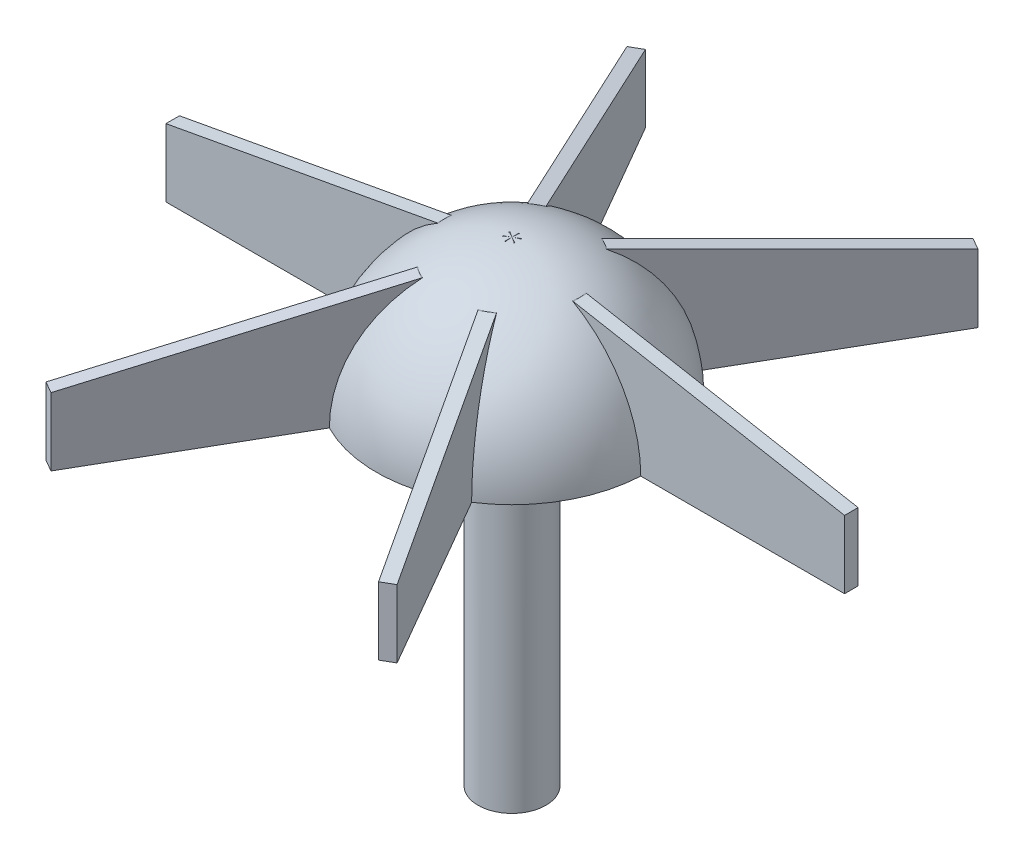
ISO-10303-21;
HEADER;
FILE_DESCRIPTION(('STEP AP214'),'2;1');
FILE_NAME('part.step','',(''),(''),'','','');
FILE_SCHEMA(('AUTOMOTIVE_DESIGN { 1 0 10303 214 1 1 1 1 }'));
ENDSEC;
DATA;
#1=APPLICATION_CONTEXT('core data for automotive mechanical design processes');
#2=APPLICATION_PROTOCOL_DEFINITION('international standard','automotive_design',2000,#1);
#3=PRODUCT_CONTEXT('',#1,'mechanical');
#4=PRODUCT('Part','Part','',(#3));
#5=PRODUCT_RELATED_PRODUCT_CATEGORY('part','',(#4));
#6=PRODUCT_DEFINITION_FORMATION('','',#4);
#7=PRODUCT_DEFINITION_CONTEXT('part definition',#1,'design');
#8=PRODUCT_DEFINITION('design','',#6,#7);
#9=PRODUCT_DEFINITION_SHAPE('','',#8);
#10=(LENGTH_UNIT() NAMED_UNIT(*) SI_UNIT(.MILLI.,.METRE.));
#11=(NAMED_UNIT(*) PLANE_ANGLE_UNIT() SI_UNIT($,.RADIAN.));
#12=(NAMED_UNIT(*) SI_UNIT($,.STERADIAN.) SOLID_ANGLE_UNIT());
#13=UNCERTAINTY_MEASURE_WITH_UNIT(LENGTH_MEASURE(1.E-05),#10,'distance_accuracy_value','');
#14=(GEOMETRIC_REPRESENTATION_CONTEXT(3) GLOBAL_UNCERTAINTY_ASSIGNED_CONTEXT((#13)) GLOBAL_UNIT_ASSIGNED_CONTEXT((#10,
#11,#12)) REPRESENTATION_CONTEXT('',''));
#15=CARTESIAN_POINT('',(0.,0.,0.));
#16=DIRECTION('',(0.,0.,1.));
#17=DIRECTION('',(1.,0.,0.));
#18=AXIS2_PLACEMENT_3D('',#15,#16,#17);
#19=CARTESIAN_POINT('',(0.,60.,0.));
#20=DIRECTION('',(0.,-1.,0.));
#21=DIRECTION('',(0.,0.,-1.));
#22=AXIS2_PLACEMENT_3D('',#19,#20,#21);
#23=SPHERICAL_SURFACE('',#22,10.);
#24=CARTESIAN_POINT('',(-2.50000000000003,69.3301270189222,0.));
#25=DIRECTION('',(0.258819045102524,-0.965925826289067,0.));
#26=DIRECTION('',(0.965925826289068,0.258819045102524,0.));
#27=AXIS2_PLACEMENT_3D('',#24,#25,#26);
#28=CIRCLE('',#27,2.58819045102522);
#29=CARTESIAN_POINT('',(0.,70.,0.));
#30=VERTEX_POINT('',#29);
#31=CARTESIAN_POINT('',(-0.0470942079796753,69.9873811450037,-0.5));
#32=VERTEX_POINT('',#31);
#33=EDGE_CURVE('E474',#30,#32,#28,.F.);
#34=ORIENTED_EDGE('',*,*,#33,.T.);
#35=CARTESIAN_POINT('',(0.,60.,-0.5));
#36=DIRECTION('',(0.,0.,-1.));
#37=DIRECTION('',(-1.,0.,0.));
#38=AXIS2_PLACEMENT_3D('',#35,#36,#37);
#39=CIRCLE('',#38,9.98749217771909);
#40=CARTESIAN_POINT('',(0.0470942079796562,69.9873811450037,-0.5));
#41=VERTEX_POINT('',#40);
#42=EDGE_CURVE('E550',#41,#32,#39,.F.);
#43=ORIENTED_EDGE('',*,*,#42,.F.);
#44=CARTESIAN_POINT('',(2.50000000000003,69.3301270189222,0.));
#45=DIRECTION('',(-0.258819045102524,-0.965925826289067,0.));
#46=DIRECTION('',(0.965925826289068,-0.258819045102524,0.));
#47=AXIS2_PLACEMENT_3D('',#44,#45,#46);
#48=CIRCLE('',#47,2.58819045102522);
#49=EDGE_CURVE('E556',#41,#30,#48,.F.);
#50=ORIENTED_EDGE('',*,*,#49,.T.);
#51=CARTESIAN_POINT('',(-1.24999999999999,69.3301270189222,-2.16506350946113));
#52=DIRECTION('',(0.12940952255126,-0.965925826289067,0.224143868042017));
#53=DIRECTION('',(0.,-0.226044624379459,-0.974116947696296));
#54=AXIS2_PLACEMENT_3D('',#51,#52,#53);
#55=CIRCLE('',#54,2.58819045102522);
#56=CARTESIAN_POINT('',(0.409465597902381,69.9873811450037,-0.290784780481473));
#57=VERTEX_POINT('',#56);
#58=EDGE_CURVE('E477',#30,#57,#55,.F.);
#59=ORIENTED_EDGE('',*,*,#58,.T.);
#60=CARTESIAN_POINT('',(0.43301270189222,60.,-0.249999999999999));
#61=DIRECTION('',(0.86602540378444,0.,-0.499999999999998));
#62=DIRECTION('',(-0.499999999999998,0.,-0.86602540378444));
#63=AXIS2_PLACEMENT_3D('',#60,#61,#62);
#64=CIRCLE('',#63,9.98749217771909);
#65=CARTESIAN_POINT('',(0.456559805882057,69.9873811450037,-0.209215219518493));
#66=VERTEX_POINT('',#65);
#67=EDGE_CURVE('E575',#66,#57,#64,.F.);
#68=ORIENTED_EDGE('',*,*,#67,.F.);
#69=CARTESIAN_POINT('',(1.25000000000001,69.3301270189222,2.16506350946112));
#70=DIRECTION('',(-0.129409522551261,-0.965925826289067,-0.224143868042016));
#71=DIRECTION('',(0.,0.226044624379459,-0.974116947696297));
#72=AXIS2_PLACEMENT_3D('',#69,#70,#71);
#73=CIRCLE('',#72,2.58819045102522);
#74=EDGE_CURVE('E572',#66,#30,#73,.F.);
#75=ORIENTED_EDGE('',*,*,#74,.T.);
#76=CARTESIAN_POINT('',(1.25000000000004,69.3301270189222,-2.16506350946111));
#77=DIRECTION('',(-0.129409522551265,-0.965925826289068,0.224143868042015));
#78=DIRECTION('',(0.,-0.226044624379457,-0.974116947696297));
#79=AXIS2_PLACEMENT_3D('',#76,#77,#78);
#80=CIRCLE('',#79,2.58819045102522);
#81=CARTESIAN_POINT('',(0.456559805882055,69.9873811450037,0.209215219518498));
#82=VERTEX_POINT('',#81);
#83=EDGE_CURVE('E561',#30,#82,#80,.F.);
#84=ORIENTED_EDGE('',*,*,#83,.T.);
#85=CARTESIAN_POINT('',(0.433012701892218,60.,0.250000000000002));
#86=DIRECTION('',(0.866025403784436,0.,0.500000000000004));
#87=DIRECTION('',(0.500000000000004,0.,-0.866025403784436));
#88=AXIS2_PLACEMENT_3D('',#85,#86,#87);
#89=CIRCLE('',#88,9.98749217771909);
#90=CARTESIAN_POINT('',(0.409465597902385,69.9873811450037,0.290784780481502));
#91=VERTEX_POINT('',#90);
#92=EDGE_CURVE('E564',#91,#82,#89,.F.);
#93=ORIENTED_EDGE('',*,*,#92,.F.);
#94=CARTESIAN_POINT('',(-1.25000000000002,69.3301270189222,2.16506350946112));
#95=DIRECTION('',(0.129409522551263,-0.965925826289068,-0.224143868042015));
#96=DIRECTION('',(0.,0.226044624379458,-0.974116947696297));
#97=AXIS2_PLACEMENT_3D('',#94,#95,#96);
#98=CIRCLE('',#97,2.58819045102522);
#99=EDGE_CURVE('E468',#91,#30,#98,.F.);
#100=ORIENTED_EDGE('',*,*,#99,.T.);
#101=CARTESIAN_POINT('',(0.0470942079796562,69.9873811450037,0.5));
#102=VERTEX_POINT('',#101);
#103=EDGE_CURVE('E552',#30,#102,#48,.F.);
#104=ORIENTED_EDGE('',*,*,#103,.T.);
#105=CARTESIAN_POINT('',(0.,60.,0.5));
#106=DIRECTION('',(0.,0.,-1.));
#107=DIRECTION('',(-1.,0.,0.));
#108=AXIS2_PLACEMENT_3D('',#105,#106,#107);
#109=CIRCLE('',#108,9.98749217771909);
#110=CARTESIAN_POINT('',(-0.0470942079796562,69.9873811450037,0.5));
#111=VERTEX_POINT('',#110);
#112=EDGE_CURVE('E558',#102,#111,#109,.F.);
#113=ORIENTED_EDGE('',*,*,#112,.T.);
#114=CARTESIAN_POINT('',(-2.50000000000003,69.3301270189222,0.));
#115=DIRECTION('',(0.258819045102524,-0.965925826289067,0.));
#116=DIRECTION('',(0.965925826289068,0.258819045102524,0.));
#117=AXIS2_PLACEMENT_3D('',#114,#115,#116);
#118=CIRCLE('',#117,2.58819045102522);
#119=EDGE_CURVE('E465',#111,#30,#118,.F.);
#120=ORIENTED_EDGE('',*,*,#119,.T.);
#121=CARTESIAN_POINT('',(1.25000000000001,69.3301270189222,2.16506350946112));
#122=DIRECTION('',(-0.129409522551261,-0.965925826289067,-0.224143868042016));
#123=DIRECTION('',(0.,0.226044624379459,-0.974116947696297));
#124=AXIS2_PLACEMENT_3D('',#121,#122,#123);
#125=CIRCLE('',#124,2.58819045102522);
#126=CARTESIAN_POINT('',(-0.409465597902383,69.9873811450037,0.290784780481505));
#127=VERTEX_POINT('',#126);
#128=EDGE_CURVE('E471',#30,#127,#125,.F.);
#129=ORIENTED_EDGE('',*,*,#128,.T.);
#130=CARTESIAN_POINT('',(-0.43301270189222,60.,0.249999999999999));
#131=DIRECTION('',(0.86602540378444,0.,-0.499999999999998));
#132=DIRECTION('',(-0.499999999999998,0.,-0.86602540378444));
#133=AXIS2_PLACEMENT_3D('',#130,#131,#132);
#134=CIRCLE('',#133,9.98749217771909);
#135=CARTESIAN_POINT('',(-0.456559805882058,69.9873811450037,0.209215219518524));
#136=VERTEX_POINT('',#135);
#137=EDGE_CURVE('E566',#127,#136,#134,.F.);
#138=ORIENTED_EDGE('',*,*,#137,.T.);
#139=CARTESIAN_POINT('',(-1.24999999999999,69.3301270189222,-2.16506350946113));
#140=DIRECTION('',(0.12940952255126,-0.965925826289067,0.224143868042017));
#141=DIRECTION('',(0.,-0.226044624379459,-0.974116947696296));
#142=AXIS2_PLACEMENT_3D('',#139,#140,#141);
#143=CIRCLE('',#142,2.58819045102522);
#144=EDGE_CURVE('E569',#136,#30,#143,.F.);
#145=ORIENTED_EDGE('',*,*,#144,.T.);
#146=CARTESIAN_POINT('',(-1.25000000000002,69.3301270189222,2.16506350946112));
#147=DIRECTION('',(0.129409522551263,-0.965925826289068,-0.224143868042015));
#148=DIRECTION('',(0.,0.226044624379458,-0.974116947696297));
#149=AXIS2_PLACEMENT_3D('',#146,#147,#148);
#150=CIRCLE('',#149,2.58819045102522);
#151=CARTESIAN_POINT('',(-0.456559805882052,69.9873811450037,-0.209215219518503));
#152=VERTEX_POINT('',#151);
#153=EDGE_CURVE('E577',#30,#152,#150,.F.);
#154=ORIENTED_EDGE('',*,*,#153,.T.);
#155=CARTESIAN_POINT('',(-0.433012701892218,60.,-0.250000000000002));
#156=DIRECTION('',(0.866025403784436,0.,0.500000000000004));
#157=DIRECTION('',(0.500000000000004,0.,-0.866025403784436));
#158=AXIS2_PLACEMENT_3D('',#155,#156,#157);
#159=CIRCLE('',#158,9.98749217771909);
#160=CARTESIAN_POINT('',(-0.409465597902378,69.9873811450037,-0.290784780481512));
#161=VERTEX_POINT('',#160);
#162=EDGE_CURVE('E580',#152,#161,#159,.F.);
#163=ORIENTED_EDGE('',*,*,#162,.T.);
#164=CARTESIAN_POINT('',(1.25000000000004,69.3301270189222,-2.16506350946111));
#165=DIRECTION('',(-0.129409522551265,-0.965925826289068,0.224143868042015));
#166=DIRECTION('',(0.,-0.226044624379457,-0.974116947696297));
#167=AXIS2_PLACEMENT_3D('',#164,#165,#166);
#168=CIRCLE('',#167,2.58819045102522);
#169=EDGE_CURVE('E480',#161,#30,#168,.F.);
#170=ORIENTED_EDGE('',*,*,#169,.T.);
#171=EDGE_LOOP('',(#34,#43,#50,#59,#68,#75,#84,#93,#100,#104,#113,#120,#129,#138,#145,#154,#163,#170));
#172=FACE_BOUND('',#171,.T.);
#173=CARTESIAN_POINT('',(0.,60.,0.));
#174=DIRECTION('',(0.,-1.,0.));
#175=DIRECTION('',(0.,0.,-1.));
#176=AXIS2_PLACEMENT_3D('',#173,#174,#175);
#177=CIRCLE('',#176,10.);
#178=CARTESIAN_POINT('',(4.56073338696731,60.,8.89942194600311));
#179=VERTEX_POINT('',#178);
#180=CARTESIAN_POINT('',(-4.56073338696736,60.,8.89942194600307));
#181=VERTEX_POINT('',#180);
#182=EDGE_CURVE('E547',#179,#181,#177,.T.);
#183=ORIENTED_EDGE('',*,*,#182,.F.);
#184=CARTESIAN_POINT('',(-0.43301270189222,60.,0.249999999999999));
#185=DIRECTION('',(0.86602540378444,0.,-0.499999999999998));
#186=DIRECTION('',(-0.499999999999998,0.,-0.86602540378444));
#187=AXIS2_PLACEMENT_3D('',#184,#185,#186);
#188=CIRCLE('',#187,9.98749217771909);
#189=CARTESIAN_POINT('',(2.04344019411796,68.6728728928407,4.53934223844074));
#190=VERTEX_POINT('',#189);
#191=EDGE_CURVE('E50',#179,#190,#188,.F.);
#192=ORIENTED_EDGE('',*,*,#191,.T.);
#193=CARTESIAN_POINT('',(1.25000000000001,69.3301270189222,2.16506350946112));
#194=DIRECTION('',(-0.129409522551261,-0.965925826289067,-0.224143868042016));
#195=DIRECTION('',(0.,0.226044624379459,-0.974116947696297));
#196=AXIS2_PLACEMENT_3D('',#193,#194,#195);
#197=CIRCLE('',#196,2.58819045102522);
#198=CARTESIAN_POINT('',(2.50000000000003,68.6602540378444,4.33012701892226));
#199=VERTEX_POINT('',#198);
#200=EDGE_CURVE('E11',#190,#199,#197,.F.);
#201=ORIENTED_EDGE('',*,*,#200,.T.);
#202=CARTESIAN_POINT('',(2.90946559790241,68.6728728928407,4.03934223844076));
#203=VERTEX_POINT('',#202);
#204=EDGE_CURVE('E40',#199,#203,#197,.F.);
#205=ORIENTED_EDGE('',*,*,#204,.T.);
#206=CARTESIAN_POINT('',(0.43301270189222,60.,-0.249999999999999));
#207=DIRECTION('',(0.86602540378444,0.,-0.499999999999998));
#208=DIRECTION('',(-0.499999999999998,0.,-0.86602540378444));
#209=AXIS2_PLACEMENT_3D('',#206,#207,#208);
#210=CIRCLE('',#209,9.98749217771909);
#211=CARTESIAN_POINT('',(5.42675879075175,60.,8.39942194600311));
#212=VERTEX_POINT('',#211);
#213=EDGE_CURVE('E504',#212,#203,#210,.F.);
#214=ORIENTED_EDGE('',*,*,#213,.F.);
#215=CARTESIAN_POINT('',(9.98749217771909,60.,0.5));
#216=VERTEX_POINT('',#215);
#217=EDGE_CURVE('E544',#216,#212,#177,.T.);
#218=ORIENTED_EDGE('',*,*,#217,.F.);
#219=CARTESIAN_POINT('',(4.95290579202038,68.6728728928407,0.5));
#220=VERTEX_POINT('',#219);
#221=EDGE_CURVE('E560',#216,#220,#109,.F.);
#222=ORIENTED_EDGE('',*,*,#221,.T.);
#223=CARTESIAN_POINT('',(5.00000000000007,68.6602540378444,0.));
#224=VERTEX_POINT('',#223);
#225=EDGE_CURVE('E557',#220,#224,#48,.F.);
#226=ORIENTED_EDGE('',*,*,#225,.T.);
#227=CARTESIAN_POINT('',(4.9529057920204,68.6728728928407,-0.5));
#228=VERTEX_POINT('',#227);
#229=EDGE_CURVE('E636',#224,#228,#48,.F.);
#230=ORIENTED_EDGE('',*,*,#229,.T.);
#231=CARTESIAN_POINT('',(9.98749217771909,60.,-0.5));
#232=VERTEX_POINT('',#231);
#233=EDGE_CURVE('E553',#232,#228,#39,.F.);
#234=ORIENTED_EDGE('',*,*,#233,.F.);
#235=CARTESIAN_POINT('',(5.42675879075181,60.,-8.39942194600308));
#236=VERTEX_POINT('',#235);
#237=EDGE_CURVE('E543',#236,#232,#177,.T.);
#238=ORIENTED_EDGE('',*,*,#237,.F.);
#239=CARTESIAN_POINT('',(0.433012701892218,60.,0.250000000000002));
#240=DIRECTION('',(0.866025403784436,0.,0.500000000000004));
#241=DIRECTION('',(0.500000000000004,0.,-0.866025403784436));
#242=AXIS2_PLACEMENT_3D('',#239,#240,#241);
#243=CIRCLE('',#242,9.98749217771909);
#244=CARTESIAN_POINT('',(2.90946559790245,68.6728728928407,-4.03934223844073));
#245=VERTEX_POINT('',#244);
#246=EDGE_CURVE('E310',#245,#236,#243,.F.);
#247=ORIENTED_EDGE('',*,*,#246,.F.);
#248=CARTESIAN_POINT('',(1.25000000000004,69.3301270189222,-2.16506350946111));
#249=DIRECTION('',(-0.129409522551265,-0.965925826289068,0.224143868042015));
#250=DIRECTION('',(0.,-0.226044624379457,-0.974116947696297));
#251=AXIS2_PLACEMENT_3D('',#248,#249,#250);
#252=CIRCLE('',#251,2.58819045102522);
#253=CARTESIAN_POINT('',(2.50000000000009,68.6602540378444,-4.33012701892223));
#254=VERTEX_POINT('',#253);
#255=EDGE_CURVE('E587',#245,#254,#252,.F.);
#256=ORIENTED_EDGE('',*,*,#255,.T.);
#257=CARTESIAN_POINT('',(2.04344019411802,68.6728728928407,-4.53934223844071));
#258=VERTEX_POINT('',#257);
#259=EDGE_CURVE('E589',#254,#258,#252,.F.);
#260=ORIENTED_EDGE('',*,*,#259,.T.);
#261=CARTESIAN_POINT('',(-0.433012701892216,60.,-0.250000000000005));
#262=DIRECTION('',(-0.866025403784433,0.,-0.50000000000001));
#263=DIRECTION('',(-0.50000000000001,0.,0.866025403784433));
#264=AXIS2_PLACEMENT_3D('',#261,#262,#263);
#265=CIRCLE('',#264,9.98749217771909);
#266=CARTESIAN_POINT('',(4.56073338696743,60.,-8.89942194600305));
#267=VERTEX_POINT('',#266);
#268=EDGE_CURVE('E496',#267,#258,#265,.F.);
#269=ORIENTED_EDGE('',*,*,#268,.F.);
#270=CARTESIAN_POINT('',(-4.56073338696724,60.,-8.89942194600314));
#271=VERTEX_POINT('',#270);
#272=EDGE_CURVE('E628',#271,#267,#177,.T.);
#273=ORIENTED_EDGE('',*,*,#272,.F.);
#274=CARTESIAN_POINT('',(0.433012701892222,60.,-0.249999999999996));
#275=DIRECTION('',(-0.866025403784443,0.,0.499999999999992));
#276=DIRECTION('',(0.499999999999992,0.,0.866025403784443));
#277=AXIS2_PLACEMENT_3D('',#274,#275,#276);
#278=CIRCLE('',#277,9.98749217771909);
#279=CARTESIAN_POINT('',(-2.04344019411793,68.6728728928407,-4.53934223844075));
#280=VERTEX_POINT('',#279);
#281=EDGE_CURVE('E493',#271,#280,#278,.F.);
#282=ORIENTED_EDGE('',*,*,#281,.T.);
#283=CARTESIAN_POINT('',(-1.24999999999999,69.3301270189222,-2.16506350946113));
#284=DIRECTION('',(0.12940952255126,-0.965925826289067,0.224143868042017));
#285=DIRECTION('',(0.,-0.226044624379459,-0.974116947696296));
#286=AXIS2_PLACEMENT_3D('',#283,#284,#285);
#287=CIRCLE('',#286,2.58819045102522);
#288=CARTESIAN_POINT('',(-2.5,68.6602540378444,-4.33012701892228));
#289=VERTEX_POINT('',#288);
#290=EDGE_CURVE('E592',#280,#289,#287,.F.);
#291=ORIENTED_EDGE('',*,*,#290,.T.);
#292=CARTESIAN_POINT('',(-2.90946559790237,68.6728728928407,-4.03934223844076));
#293=VERTEX_POINT('',#292);
#294=EDGE_CURVE('E590',#289,#293,#287,.F.);
#295=ORIENTED_EDGE('',*,*,#294,.T.);
#296=CARTESIAN_POINT('',(-0.433012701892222,60.,0.249999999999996));
#297=DIRECTION('',(-0.866025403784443,0.,0.499999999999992));
#298=DIRECTION('',(0.499999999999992,0.,0.866025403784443));
#299=AXIS2_PLACEMENT_3D('',#296,#297,#298);
#300=CIRCLE('',#299,9.98749217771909);
#301=CARTESIAN_POINT('',(-5.42675879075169,60.,-8.39942194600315));
#302=VERTEX_POINT('',#301);
#303=EDGE_CURVE('E490',#302,#293,#300,.F.);
#304=ORIENTED_EDGE('',*,*,#303,.F.);
#305=CARTESIAN_POINT('',(-9.98749217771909,60.,-0.5));
#306=VERTEX_POINT('',#305);
#307=EDGE_CURVE('E623',#306,#302,#177,.T.);
#308=ORIENTED_EDGE('',*,*,#307,.F.);
#309=CARTESIAN_POINT('',(0.,60.,-0.5));
#310=DIRECTION('',(0.,0.,1.));
#311=DIRECTION('',(1.,0.,0.));
#312=AXIS2_PLACEMENT_3D('',#309,#310,#311);
#313=CIRCLE('',#312,9.98749217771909);
#314=CARTESIAN_POINT('',(-4.9529057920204,68.6728728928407,-0.5));
#315=VERTEX_POINT('',#314);
#316=EDGE_CURVE('E499',#306,#315,#313,.F.);
#317=ORIENTED_EDGE('',*,*,#316,.T.);
#318=CARTESIAN_POINT('',(-2.50000000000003,69.3301270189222,0.));
#319=DIRECTION('',(0.258819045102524,-0.965925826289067,0.));
#320=DIRECTION('',(0.965925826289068,0.258819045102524,0.));
#321=AXIS2_PLACEMENT_3D('',#318,#319,#320);
#322=CIRCLE('',#321,2.58819045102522);
#323=CARTESIAN_POINT('',(-5.00000000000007,68.6602540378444,0.));
#324=VERTEX_POINT('',#323);
#325=EDGE_CURVE('E593',#315,#324,#322,.F.);
#326=ORIENTED_EDGE('',*,*,#325,.T.);
#327=CARTESIAN_POINT('',(-4.9529057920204,68.6728728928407,0.5));
#328=VERTEX_POINT('',#327);
#329=EDGE_CURVE('E595',#324,#328,#322,.F.);
#330=ORIENTED_EDGE('',*,*,#329,.T.);
#331=CARTESIAN_POINT('',(0.,60.,0.5));
#332=DIRECTION('',(0.,0.,1.));
#333=DIRECTION('',(1.,0.,0.));
#334=AXIS2_PLACEMENT_3D('',#331,#332,#333);
#335=CIRCLE('',#334,9.98749217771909);
#336=CARTESIAN_POINT('',(-9.98749217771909,60.,0.5));
#337=VERTEX_POINT('',#336);
#338=EDGE_CURVE('E502',#337,#328,#335,.F.);
#339=ORIENTED_EDGE('',*,*,#338,.F.);
#340=CARTESIAN_POINT('',(-5.4267587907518,60.,8.39942194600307));
#341=VERTEX_POINT('',#340);
#342=EDGE_CURVE('E627',#341,#337,#177,.T.);
#343=ORIENTED_EDGE('',*,*,#342,.F.);
#344=CARTESIAN_POINT('',(-0.433012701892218,60.,-0.250000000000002));
#345=DIRECTION('',(0.866025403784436,0.,0.500000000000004));
#346=DIRECTION('',(0.500000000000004,0.,-0.866025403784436));
#347=AXIS2_PLACEMENT_3D('',#344,#345,#346);
#348=CIRCLE('',#347,9.98749217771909);
#349=CARTESIAN_POINT('',(-2.90946559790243,68.6728728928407,4.03934223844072));
#350=VERTEX_POINT('',#349);
#351=EDGE_CURVE('E486',#341,#350,#348,.F.);
#352=ORIENTED_EDGE('',*,*,#351,.T.);
#353=CARTESIAN_POINT('',(-1.25000000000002,69.3301270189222,2.16506350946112));
#354=DIRECTION('',(0.129409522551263,-0.965925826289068,-0.224143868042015));
#355=DIRECTION('',(0.,0.226044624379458,-0.974116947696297));
#356=AXIS2_PLACEMENT_3D('',#353,#354,#355);
#357=CIRCLE('',#356,2.58819045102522);
#358=CARTESIAN_POINT('',(-2.50000000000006,68.6602540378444,4.33012701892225));
#359=VERTEX_POINT('',#358);
#360=EDGE_CURVE('E586',#350,#359,#357,.F.);
#361=ORIENTED_EDGE('',*,*,#360,.T.);
#362=CARTESIAN_POINT('',(-2.04344019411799,68.6728728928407,4.53934223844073));
#363=VERTEX_POINT('',#362);
#364=EDGE_CURVE('E583',#359,#363,#357,.F.);
#365=ORIENTED_EDGE('',*,*,#364,.T.);
#366=CARTESIAN_POINT('',(0.433012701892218,60.,0.250000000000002));
#367=DIRECTION('',(0.866025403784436,0.,0.500000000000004));
#368=DIRECTION('',(0.500000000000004,0.,-0.866025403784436));
#369=AXIS2_PLACEMENT_3D('',#366,#367,#368);
#370=CIRCLE('',#369,9.98749217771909);
#371=EDGE_CURVE('E483',#181,#363,#370,.F.);
#372=ORIENTED_EDGE('',*,*,#371,.F.);
#373=EDGE_LOOP('',(#183,#192,#201,#205,#214,#218,#222,#226,#230,#234,#238,#247,#256,#260,#269,
#273,#282,#291,#295,#304,#308,#317,#326,#330,#339,#343,#352,#361,#365,#372));
#374=FACE_BOUND('',#373,.T.);
#375=ADVANCED_FACE('F36',(#172,#374),#23,.T.);
#376=CARTESIAN_POINT('',(0.,60.,0.));
#377=DIRECTION('',(0.,-1.,0.));
#378=DIRECTION('',(0.,0.,-1.));
#379=AXIS2_PLACEMENT_3D('',#376,#377,#378);
#380=CYLINDRICAL_SURFACE('',#379,2.5);
#381=CARTESIAN_POINT('',(0.,60.,0.));
#382=DIRECTION('',(0.,1.,0.));
#383=DIRECTION('',(0.,0.,1.));
#384=AXIS2_PLACEMENT_3D('',#381,#382,#383);
#385=CIRCLE('',#384,2.5);
#386=CARTESIAN_POINT('',(0.,60.,2.5));
#387=VERTEX_POINT('',#386);
#388=EDGE_CURVE('E546',#387,#387,#385,.T.);
#389=ORIENTED_EDGE('',*,*,#388,.F.);
#390=EDGE_LOOP('',(#389));
#391=FACE_BOUND('',#390,.T.);
#392=CARTESIAN_POINT('',(0.,35.,0.));
#393=DIRECTION('',(0.,-1.,0.));
#394=DIRECTION('',(0.,0.,-1.));
#395=AXIS2_PLACEMENT_3D('',#392,#393,#394);
#396=CIRCLE('',#395,2.5);
#397=CARTESIAN_POINT('',(0.,35.,-2.5));
#398=VERTEX_POINT('',#397);
#399=EDGE_CURVE('E1271',#398,#398,#396,.T.);
#400=ORIENTED_EDGE('',*,*,#399,.F.);
#401=EDGE_LOOP('',(#400));
#402=FACE_BOUND('',#401,.T.);
#403=ADVANCED_FACE('F38',(#391,#402),#380,.T.);
#404=CARTESIAN_POINT('',(0.,60.,-10.));
#405=DIRECTION('',(0.,-1.,0.));
#406=DIRECTION('',(0.,0.,-1.));
#407=AXIS2_PLACEMENT_3D('',#404,#405,#406);
#408=PLANE('',#407);
#409=ORIENTED_EDGE('',*,*,#217,.T.);
#410=DIRECTION('',(0.499999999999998,0.,0.86602540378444));
#411=VECTOR('',#410,1.);
#412=CARTESIAN_POINT('',(12.9330127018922,60.,21.400635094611));
#413=LINE('',#412,#411);
#414=CARTESIAN_POINT('',(12.9330127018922,60.,21.400635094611));
#415=VERTEX_POINT('',#414);
#416=EDGE_CURVE('E431',#212,#415,#413,.T.);
#417=ORIENTED_EDGE('',*,*,#416,.T.);
#418=DIRECTION('',(0.86602540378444,0.,-0.499999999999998));
#419=VECTOR('',#418,1.);
#420=CARTESIAN_POINT('',(12.0669872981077,60.,21.900635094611));
#421=LINE('',#420,#419);
#422=CARTESIAN_POINT('',(12.0669872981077,60.,21.900635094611));
#423=VERTEX_POINT('',#422);
#424=EDGE_CURVE('E462',#423,#415,#421,.T.);
#425=ORIENTED_EDGE('',*,*,#424,.F.);
#426=DIRECTION('',(0.499999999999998,0.,0.86602540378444));
#427=VECTOR('',#426,1.);
#428=CARTESIAN_POINT('',(12.0669872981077,60.,21.900635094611));
#429=LINE('',#428,#427);
#430=EDGE_CURVE('E432',#179,#423,#429,.T.);
#431=ORIENTED_EDGE('',*,*,#430,.F.);
#432=ORIENTED_EDGE('',*,*,#182,.T.);
#433=DIRECTION('',(-0.500000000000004,0.,0.866025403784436));
#434=VECTOR('',#433,1.);
#435=CARTESIAN_POINT('',(-12.0669872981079,60.,21.9006350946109));
#436=LINE('',#435,#434);
#437=CARTESIAN_POINT('',(-12.0669872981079,60.,21.9006350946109));
#438=VERTEX_POINT('',#437);
#439=EDGE_CURVE('E314',#181,#438,#436,.T.);
#440=ORIENTED_EDGE('',*,*,#439,.T.);
#441=DIRECTION('',(0.866025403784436,0.,0.500000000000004));
#442=VECTOR('',#441,1.);
#443=CARTESIAN_POINT('',(-12.9330127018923,60.,21.4006350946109));
#444=LINE('',#443,#442);
#445=CARTESIAN_POINT('',(-12.9330127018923,60.,21.4006350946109));
#446=VERTEX_POINT('',#445);
#447=EDGE_CURVE('E428',#446,#438,#444,.T.);
#448=ORIENTED_EDGE('',*,*,#447,.F.);
#449=DIRECTION('',(-0.500000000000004,0.,0.866025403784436));
#450=VECTOR('',#449,1.);
#451=CARTESIAN_POINT('',(-12.9330127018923,60.,21.4006350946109));
#452=LINE('',#451,#450);
#453=EDGE_CURVE('E401',#341,#446,#452,.T.);
#454=ORIENTED_EDGE('',*,*,#453,.F.);
#455=ORIENTED_EDGE('',*,*,#342,.T.);
#456=DIRECTION('',(-1.,0.,0.));
#457=VECTOR('',#456,1.);
#458=CARTESIAN_POINT('',(-25.,60.,0.5));
#459=LINE('',#458,#457);
#460=CARTESIAN_POINT('',(-25.,60.,0.5));
#461=VERTEX_POINT('',#460);
#462=EDGE_CURVE('E371',#337,#461,#459,.T.);
#463=ORIENTED_EDGE('',*,*,#462,.T.);
#464=DIRECTION('',(0.,0.,1.));
#465=VECTOR('',#464,1.);
#466=CARTESIAN_POINT('',(-25.,60.,-0.5));
#467=LINE('',#466,#465);
#468=CARTESIAN_POINT('',(-25.,60.,-0.5));
#469=VERTEX_POINT('',#468);
#470=EDGE_CURVE('E398',#469,#461,#467,.T.);
#471=ORIENTED_EDGE('',*,*,#470,.F.);
#472=DIRECTION('',(-1.,0.,0.));
#473=VECTOR('',#472,1.);
#474=CARTESIAN_POINT('',(-25.,60.,-0.5));
#475=LINE('',#474,#473);
#476=EDGE_CURVE('E372',#306,#469,#475,.T.);
#477=ORIENTED_EDGE('',*,*,#476,.F.);
#478=ORIENTED_EDGE('',*,*,#307,.T.);
#479=DIRECTION('',(-0.499999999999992,0.,-0.866025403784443));
#480=VECTOR('',#479,1.);
#481=CARTESIAN_POINT('',(-12.933012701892,60.,-21.4006350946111));
#482=LINE('',#481,#480);
#483=CARTESIAN_POINT('',(-12.933012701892,60.,-21.4006350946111));
#484=VERTEX_POINT('',#483);
#485=EDGE_CURVE('E333',#302,#484,#482,.T.);
#486=ORIENTED_EDGE('',*,*,#485,.T.);
#487=DIRECTION('',(-0.866025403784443,0.,0.499999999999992));
#488=VECTOR('',#487,1.);
#489=CARTESIAN_POINT('',(-12.0669872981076,60.,-21.9006350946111));
#490=LINE('',#489,#488);
#491=CARTESIAN_POINT('',(-12.0669872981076,60.,-21.9006350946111));
#492=VERTEX_POINT('',#491);
#493=EDGE_CURVE('E368',#492,#484,#490,.T.);
#494=ORIENTED_EDGE('',*,*,#493,.F.);
#495=DIRECTION('',(-0.499999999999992,0.,-0.866025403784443));
#496=VECTOR('',#495,1.);
#497=CARTESIAN_POINT('',(-12.0669872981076,60.,-21.9006350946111));
#498=LINE('',#497,#496);
#499=EDGE_CURVE('E341',#271,#492,#498,.T.);
#500=ORIENTED_EDGE('',*,*,#499,.F.);
#501=ORIENTED_EDGE('',*,*,#272,.T.);
#502=DIRECTION('',(0.50000000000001,0.,-0.866025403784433));
#503=VECTOR('',#502,1.);
#504=CARTESIAN_POINT('',(12.066987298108,60.,-21.9006350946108));
#505=LINE('',#504,#503);
#506=CARTESIAN_POINT('',(12.066987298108,60.,-21.9006350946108));
#507=VERTEX_POINT('',#506);
#508=EDGE_CURVE('E331',#267,#507,#505,.T.);
#509=ORIENTED_EDGE('',*,*,#508,.T.);
#510=DIRECTION('',(-0.866025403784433,0.,-0.50000000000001));
#511=VECTOR('',#510,1.);
#512=CARTESIAN_POINT('',(12.9330127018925,60.,-21.4006350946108));
#513=LINE('',#512,#511);
#514=CARTESIAN_POINT('',(12.9330127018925,60.,-21.4006350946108));
#515=VERTEX_POINT('',#514);
#516=EDGE_CURVE('E319',#515,#507,#513,.T.);
#517=ORIENTED_EDGE('',*,*,#516,.F.);
#518=EDGE_CURVE('E304',#515,#236,#436,.T.);
#519=ORIENTED_EDGE('',*,*,#518,.T.);
#520=ORIENTED_EDGE('',*,*,#237,.T.);
#521=DIRECTION('',(1.,0.,0.));
#522=VECTOR('',#521,1.);
#523=CARTESIAN_POINT('',(25.,60.,-0.5));
#524=LINE('',#523,#522);
#525=CARTESIAN_POINT('',(25.,60.,-0.5));
#526=VERTEX_POINT('',#525);
#527=EDGE_CURVE('E508',#232,#526,#524,.T.);
#528=ORIENTED_EDGE('',*,*,#527,.T.);
#529=DIRECTION('',(0.,0.,-1.));
#530=VECTOR('',#529,1.);
#531=CARTESIAN_POINT('',(25.,60.,0.5));
#532=LINE('',#531,#530);
#533=CARTESIAN_POINT('',(25.,60.,0.5));
#534=VERTEX_POINT('',#533);
#535=EDGE_CURVE('E540',#534,#526,#532,.T.);
#536=ORIENTED_EDGE('',*,*,#535,.F.);
#537=DIRECTION('',(1.,0.,0.));
#538=VECTOR('',#537,1.);
#539=CARTESIAN_POINT('',(25.,60.,0.5));
#540=LINE('',#539,#538);
#541=EDGE_CURVE('E509',#216,#534,#540,.T.);
#542=ORIENTED_EDGE('',*,*,#541,.F.);
#543=EDGE_LOOP('',(#409,#417,#425,#431,#432,#440,#448,#454,#455,#463,#471,#477,#478,#486,#494,
#500,#501,#509,#517,#519,#520,#528,#536,#542));
#544=FACE_BOUND('',#543,.T.);
#545=ORIENTED_EDGE('',*,*,#388,.T.);
#546=EDGE_LOOP('',(#545));
#547=FACE_BOUND('',#546,.T.);
#548=ADVANCED_FACE('F327',(#544,#547),#408,.T.);
#549=CARTESIAN_POINT('',(0.,0.,-0.5));
#550=DIRECTION('',(0.,0.,-1.));
#551=DIRECTION('',(-1.,0.,0.));
#552=AXIS2_PLACEMENT_3D('',#549,#550,#551);
#553=PLANE('',#552);
#554=DIRECTION('',(-0.965925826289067,0.258819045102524,0.));
#555=VECTOR('',#554,1.);
#556=CARTESIAN_POINT('',(0.,70.,-0.5));
#557=LINE('',#556,#555);
#558=CARTESIAN_POINT('',(0.,70.,-0.5));
#559=VERTEX_POINT('',#558);
#560=EDGE_CURVE('E527',#41,#559,#557,.T.);
#561=ORIENTED_EDGE('',*,*,#560,.F.);
#562=ORIENTED_EDGE('',*,*,#42,.T.);
#563=DIRECTION('',(0.965925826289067,0.258819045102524,0.));
#564=VECTOR('',#563,1.);
#565=CARTESIAN_POINT('',(0.,70.,-0.5));
#566=LINE('',#565,#564);
#567=EDGE_CURVE('E379',#32,#559,#566,.T.);
#568=ORIENTED_EDGE('',*,*,#567,.T.);
#569=EDGE_LOOP('',(#561,#562,#568));
#570=FACE_BOUND('',#569,.T.);
#571=ADVANCED_FACE('F726',(#570),#553,.T.);
#572=CARTESIAN_POINT('',(0.,70.,0.5));
#573=DIRECTION('',(-0.258819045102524,-0.965925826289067,0.));
#574=DIRECTION('',(0.965925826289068,-0.258819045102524,0.));
#575=AXIS2_PLACEMENT_3D('',#572,#573,#574);
#576=PLANE('',#575);
#577=ORIENTED_EDGE('',*,*,#49,.F.);
#578=ORIENTED_EDGE('',*,*,#560,.T.);
#579=DIRECTION('',(0.,0.,-1.));
#580=VECTOR('',#579,1.);
#581=CARTESIAN_POINT('',(0.,70.,0.5));
#582=LINE('',#581,#580);
#583=EDGE_CURVE('E520',#30,#559,#582,.T.);
#584=ORIENTED_EDGE('',*,*,#583,.F.);
#585=EDGE_LOOP('',(#577,#578,#584));
#586=FACE_BOUND('',#585,.T.);
#587=ADVANCED_FACE('F662',(#586),#576,.F.);
#588=ORIENTED_EDGE('',*,*,#225,.F.);
#589=DIRECTION('',(-0.965925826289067,0.258819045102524,0.));
#590=VECTOR('',#589,1.);
#591=CARTESIAN_POINT('',(0.,70.,0.5));
#592=LINE('',#591,#590);
#593=CARTESIAN_POINT('',(5.00000000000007,68.6602540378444,0.5));
#594=VERTEX_POINT('',#593);
#595=EDGE_CURVE('E517',#594,#220,#592,.T.);
#596=ORIENTED_EDGE('',*,*,#595,.F.);
#597=DIRECTION('',(0.,0.,-1.));
#598=VECTOR('',#597,1.);
#599=CARTESIAN_POINT('',(5.00000000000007,68.6602540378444,0.5));
#600=LINE('',#599,#598);
#601=EDGE_CURVE('E534',#594,#224,#600,.T.);
#602=ORIENTED_EDGE('',*,*,#601,.T.);
#603=EDGE_LOOP('',(#588,#596,#602));
#604=FACE_BOUND('',#603,.T.);
#605=ADVANCED_FACE('F735',(#604),#576,.F.);
#606=CARTESIAN_POINT('',(5.00000000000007,68.6602540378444,0.5));
#607=DIRECTION('',(-0.180022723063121,-0.983662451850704,0.));
#608=DIRECTION('',(0.983662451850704,-0.180022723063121,0.));
#609=AXIS2_PLACEMENT_3D('',#606,#607,#608);
#610=PLANE('',#609);
#611=DIRECTION('',(-0.983662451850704,0.180022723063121,0.));
#612=VECTOR('',#611,1.);
#613=CARTESIAN_POINT('',(5.00000000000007,68.6602540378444,-0.5));
#614=LINE('',#613,#612);
#615=CARTESIAN_POINT('',(25.,65.,-0.5));
#616=VERTEX_POINT('',#615);
#617=CARTESIAN_POINT('',(5.00000000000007,68.6602540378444,-0.5));
#618=VERTEX_POINT('',#617);
#619=EDGE_CURVE('E524',#616,#618,#614,.T.);
#620=ORIENTED_EDGE('',*,*,#619,.T.);
#621=EDGE_CURVE('E533',#224,#618,#600,.T.);
#622=ORIENTED_EDGE('',*,*,#621,.F.);
#623=ORIENTED_EDGE('',*,*,#601,.F.);
#624=DIRECTION('',(-0.983662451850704,0.180022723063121,0.));
#625=VECTOR('',#624,1.);
#626=CARTESIAN_POINT('',(5.00000000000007,68.6602540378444,0.5));
#627=LINE('',#626,#625);
#628=CARTESIAN_POINT('',(25.,65.,0.5));
#629=VERTEX_POINT('',#628);
#630=EDGE_CURVE('E514',#629,#594,#627,.T.);
#631=ORIENTED_EDGE('',*,*,#630,.F.);
#632=DIRECTION('',(0.,0.,-1.));
#633=VECTOR('',#632,1.);
#634=CARTESIAN_POINT('',(25.,65.,0.5));
#635=LINE('',#634,#633);
#636=EDGE_CURVE('E537',#629,#616,#635,.T.);
#637=ORIENTED_EDGE('',*,*,#636,.T.);
#638=EDGE_LOOP('',(#620,#622,#623,#631,#637));
#639=FACE_BOUND('',#638,.T.);
#640=ADVANCED_FACE('F744',(#639),#610,.F.);
#641=CARTESIAN_POINT('',(25.,65.,0.5));
#642=DIRECTION('',(-1.,0.,0.));
#643=DIRECTION('',(0.,0.,1.));
#644=AXIS2_PLACEMENT_3D('',#641,#642,#643);
#645=PLANE('',#644);
#646=DIRECTION('',(0.,1.,0.));
#647=VECTOR('',#646,1.);
#648=CARTESIAN_POINT('',(25.,65.,-0.5));
#649=LINE('',#648,#647);
#650=EDGE_CURVE('E522',#526,#616,#649,.T.);
#651=ORIENTED_EDGE('',*,*,#650,.T.);
#652=ORIENTED_EDGE('',*,*,#636,.F.);
#653=DIRECTION('',(0.,1.,0.));
#654=VECTOR('',#653,1.);
#655=CARTESIAN_POINT('',(25.,65.,0.5));
#656=LINE('',#655,#654);
#657=EDGE_CURVE('E511',#534,#629,#656,.T.);
#658=ORIENTED_EDGE('',*,*,#657,.F.);
#659=ORIENTED_EDGE('',*,*,#535,.T.);
#660=EDGE_LOOP('',(#651,#652,#658,#659));
#661=FACE_BOUND('',#660,.T.);
#662=ADVANCED_FACE('F644',(#661),#645,.F.);
#663=ORIENTED_EDGE('',*,*,#527,.F.);
#664=ORIENTED_EDGE('',*,*,#233,.T.);
#665=EDGE_CURVE('E512',#618,#228,#557,.T.);
#666=ORIENTED_EDGE('',*,*,#665,.F.);
#667=ORIENTED_EDGE('',*,*,#619,.F.);
#668=ORIENTED_EDGE('',*,*,#650,.F.);
#669=EDGE_LOOP('',(#663,#664,#666,#667,#668));
#670=FACE_BOUND('',#669,.T.);
#671=ADVANCED_FACE('F639',(#670),#553,.T.);
#672=CARTESIAN_POINT('',(0.,0.,0.5));
#673=DIRECTION('',(0.,0.,-1.));
#674=DIRECTION('',(-1.,0.,0.));
#675=AXIS2_PLACEMENT_3D('',#672,#673,#674);
#676=PLANE('',#675);
#677=ORIENTED_EDGE('',*,*,#221,.F.);
#678=ORIENTED_EDGE('',*,*,#541,.T.);
#679=ORIENTED_EDGE('',*,*,#657,.T.);
#680=ORIENTED_EDGE('',*,*,#630,.T.);
#681=ORIENTED_EDGE('',*,*,#595,.T.);
#682=EDGE_LOOP('',(#677,#678,#679,#680,#681));
#683=FACE_BOUND('',#682,.T.);
#684=ADVANCED_FACE('F649',(#683),#676,.F.);
#685=ORIENTED_EDGE('',*,*,#229,.F.);
#686=ORIENTED_EDGE('',*,*,#621,.T.);
#687=ORIENTED_EDGE('',*,*,#665,.T.);
#688=EDGE_LOOP('',(#685,#686,#687));
#689=FACE_BOUND('',#688,.T.);
#690=ADVANCED_FACE('F743',(#689),#576,.F.);
#691=ORIENTED_EDGE('',*,*,#103,.F.);
#692=CARTESIAN_POINT('',(0.,70.,0.5));
#693=VERTEX_POINT('',#692);
#694=EDGE_CURVE('E530',#693,#30,#582,.T.);
#695=ORIENTED_EDGE('',*,*,#694,.F.);
#696=EDGE_CURVE('E516',#102,#693,#592,.T.);
#697=ORIENTED_EDGE('',*,*,#696,.F.);
#698=EDGE_LOOP('',(#691,#695,#697));
#699=FACE_BOUND('',#698,.T.);
#700=ADVANCED_FACE('F683',(#699),#576,.F.);
#701=ORIENTED_EDGE('',*,*,#112,.F.);
#702=ORIENTED_EDGE('',*,*,#696,.T.);
#703=DIRECTION('',(0.965925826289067,0.258819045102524,0.));
#704=VECTOR('',#703,1.);
#705=CARTESIAN_POINT('',(0.,70.,0.5));
#706=LINE('',#705,#704);
#707=EDGE_CURVE('E389',#111,#693,#706,.T.);
#708=ORIENTED_EDGE('',*,*,#707,.F.);
#709=EDGE_LOOP('',(#701,#702,#708));
#710=FACE_BOUND('',#709,.T.);
#711=ADVANCED_FACE('F680',(#710),#676,.F.);
#712=CARTESIAN_POINT('',(0.,70.,-0.5));
#713=DIRECTION('',(0.258819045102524,-0.965925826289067,0.));
#714=DIRECTION('',(0.965925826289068,0.258819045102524,0.));
#715=AXIS2_PLACEMENT_3D('',#712,#713,#714);
#716=PLANE('',#715);
#717=ORIENTED_EDGE('',*,*,#119,.F.);
#718=ORIENTED_EDGE('',*,*,#707,.T.);
#719=ORIENTED_EDGE('',*,*,#694,.T.);
#720=EDGE_LOOP('',(#717,#718,#719));
#721=FACE_BOUND('',#720,.T.);
#722=ADVANCED_FACE('F675',(#721),#716,.F.);
#723=ORIENTED_EDGE('',*,*,#33,.F.);
#724=ORIENTED_EDGE('',*,*,#583,.T.);
#725=ORIENTED_EDGE('',*,*,#567,.F.);
#726=EDGE_LOOP('',(#723,#724,#725));
#727=FACE_BOUND('',#726,.T.);
#728=ADVANCED_FACE('F767',(#727),#716,.F.);
#729=CARTESIAN_POINT('',(0.433012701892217,70.,0.250000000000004));
#730=DIRECTION('',(-0.129409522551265,-0.965925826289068,0.224143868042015));
#731=DIRECTION('',(0.,-0.226044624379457,-0.974116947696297));
#732=AXIS2_PLACEMENT_3D('',#729,#730,#731);
#733=PLANE('',#732);
#734=ORIENTED_EDGE('',*,*,#83,.F.);
#735=DIRECTION('',(-0.866025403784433,0.,-0.50000000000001));
#736=VECTOR('',#735,1.);
#737=CARTESIAN_POINT('',(0.433012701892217,70.,0.250000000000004));
#738=LINE('',#737,#736);
#739=CARTESIAN_POINT('',(0.433012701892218,70.,0.250000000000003));
#740=VERTEX_POINT('',#739);
#741=EDGE_CURVE('E1251',#740,#30,#738,.T.);
#742=ORIENTED_EDGE('',*,*,#741,.F.);
#743=DIRECTION('',(-0.482962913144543,0.258819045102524,0.836516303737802));
#744=VECTOR('',#743,1.);
#745=CARTESIAN_POINT('',(0.433012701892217,70.,0.250000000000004));
#746=LINE('',#745,#744);
#747=EDGE_CURVE('E1252',#82,#740,#746,.T.);
#748=ORIENTED_EDGE('',*,*,#747,.F.);
#749=EDGE_LOOP('',(#734,#742,#748));
#750=FACE_BOUND('',#749,.T.);
#751=ADVANCED_FACE('F1005',(#750),#733,.F.);
#752=CARTESIAN_POINT('',(0.433012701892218,0.,0.250000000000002));
#753=DIRECTION('',(0.866025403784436,0.,0.500000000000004));
#754=DIRECTION('',(0.500000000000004,0.,-0.866025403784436));
#755=AXIS2_PLACEMENT_3D('',#752,#753,#754);
#756=PLANE('',#755);
#757=DIRECTION('',(0.482962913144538,0.258819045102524,-0.836516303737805));
#758=VECTOR('',#757,1.);
#759=CARTESIAN_POINT('',(0.433012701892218,70.,0.250000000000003));
#760=LINE('',#759,#758);
#761=EDGE_CURVE('E417',#91,#740,#760,.T.);
#762=ORIENTED_EDGE('',*,*,#761,.F.);
#763=ORIENTED_EDGE('',*,*,#92,.T.);
#764=ORIENTED_EDGE('',*,*,#747,.T.);
#765=EDGE_LOOP('',(#762,#763,#764));
#766=FACE_BOUND('',#765,.T.);
#767=ADVANCED_FACE('F808',(#766),#756,.T.);
#768=CARTESIAN_POINT('',(-0.433012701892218,70.,-0.250000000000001));
#769=DIRECTION('',(0.129409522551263,-0.965925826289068,-0.224143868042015));
#770=DIRECTION('',(0.,0.226044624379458,-0.974116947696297));
#771=AXIS2_PLACEMENT_3D('',#768,#769,#770);
#772=PLANE('',#771);
#773=ORIENTED_EDGE('',*,*,#99,.F.);
#774=ORIENTED_EDGE('',*,*,#761,.T.);
#775=ORIENTED_EDGE('',*,*,#741,.T.);
#776=EDGE_LOOP('',(#773,#774,#775));
#777=FACE_BOUND('',#776,.T.);
#778=ADVANCED_FACE('F802',(#777),#772,.F.);
#779=CARTESIAN_POINT('',(-0.43301270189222,70.,0.25));
#780=DIRECTION('',(-0.129409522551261,-0.965925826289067,-0.224143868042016));
#781=DIRECTION('',(0.,0.226044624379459,-0.974116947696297));
#782=AXIS2_PLACEMENT_3D('',#779,#780,#781);
#783=PLANE('',#782);
#784=ORIENTED_EDGE('',*,*,#128,.F.);
#785=DIRECTION('',(0.86602540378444,0.,-0.499999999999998));
#786=VECTOR('',#785,1.);
#787=CARTESIAN_POINT('',(-0.43301270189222,70.,0.25));
#788=LINE('',#787,#786);
#789=CARTESIAN_POINT('',(-0.43301270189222,70.,0.25));
#790=VERTEX_POINT('',#789);
#791=EDGE_CURVE('E443',#790,#30,#788,.T.);
#792=ORIENTED_EDGE('',*,*,#791,.F.);
#793=DIRECTION('',(-0.482962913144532,0.258819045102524,-0.836516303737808));
#794=VECTOR('',#793,1.);
#795=CARTESIAN_POINT('',(-0.43301270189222,70.,0.25));
#796=LINE('',#795,#794);
#797=EDGE_CURVE('E439',#127,#790,#796,.T.);
#798=ORIENTED_EDGE('',*,*,#797,.F.);
#799=EDGE_LOOP('',(#784,#792,#798));
#800=FACE_BOUND('',#799,.T.);
#801=ADVANCED_FACE('F785',(#800),#783,.F.);
#802=CARTESIAN_POINT('',(-0.43301270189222,0.,0.249999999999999));
#803=DIRECTION('',(0.86602540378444,0.,-0.499999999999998));
#804=DIRECTION('',(-0.499999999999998,0.,-0.86602540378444));
#805=AXIS2_PLACEMENT_3D('',#802,#803,#804);
#806=PLANE('',#805);
#807=ORIENTED_EDGE('',*,*,#137,.F.);
#808=ORIENTED_EDGE('',*,*,#797,.T.);
#809=DIRECTION('',(0.482962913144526,0.258819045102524,0.836516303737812));
#810=VECTOR('',#809,1.);
#811=CARTESIAN_POINT('',(-0.433012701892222,70.,0.249999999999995));
#812=LINE('',#811,#810);
#813=EDGE_CURVE('E357',#136,#790,#812,.T.);
#814=ORIENTED_EDGE('',*,*,#813,.F.);
#815=EDGE_LOOP('',(#807,#808,#814));
#816=FACE_BOUND('',#815,.T.);
#817=ADVANCED_FACE('F792',(#816),#806,.F.);
#818=CARTESIAN_POINT('',(0.433012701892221,70.,-0.249999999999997));
#819=DIRECTION('',(0.12940952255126,-0.965925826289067,0.224143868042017));
#820=DIRECTION('',(0.,-0.226044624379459,-0.974116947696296));
#821=AXIS2_PLACEMENT_3D('',#818,#819,#820);
#822=PLANE('',#821);
#823=ORIENTED_EDGE('',*,*,#144,.F.);
#824=ORIENTED_EDGE('',*,*,#813,.T.);
#825=ORIENTED_EDGE('',*,*,#791,.T.);
#826=EDGE_LOOP('',(#823,#824,#825));
#827=FACE_BOUND('',#826,.T.);
#828=ADVANCED_FACE('F715',(#827),#822,.F.);
#829=ORIENTED_EDGE('',*,*,#74,.F.);
#830=DIRECTION('',(-0.482962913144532,0.258819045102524,-0.836516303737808));
#831=VECTOR('',#830,1.);
#832=CARTESIAN_POINT('',(0.43301270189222,70.,-0.249999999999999));
#833=LINE('',#832,#831);
#834=CARTESIAN_POINT('',(0.43301270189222,70.,-0.249999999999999));
#835=VERTEX_POINT('',#834);
#836=EDGE_CURVE('E450',#66,#835,#833,.T.);
#837=ORIENTED_EDGE('',*,*,#836,.T.);
#838=DIRECTION('',(-0.866025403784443,0.,0.499999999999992));
#839=VECTOR('',#838,1.);
#840=CARTESIAN_POINT('',(0.433012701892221,70.,-0.249999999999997));
#841=LINE('',#840,#839);
#842=EDGE_CURVE('E351',#835,#30,#841,.T.);
#843=ORIENTED_EDGE('',*,*,#842,.T.);
#844=EDGE_LOOP('',(#829,#837,#843));
#845=FACE_BOUND('',#844,.T.);
#846=ADVANCED_FACE('F692',(#845),#783,.F.);
#847=CARTESIAN_POINT('',(0.43301270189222,0.,-0.249999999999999));
#848=DIRECTION('',(0.86602540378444,0.,-0.499999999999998));
#849=DIRECTION('',(-0.499999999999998,0.,-0.86602540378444));
#850=AXIS2_PLACEMENT_3D('',#847,#848,#849);
#851=PLANE('',#850);
#852=ORIENTED_EDGE('',*,*,#836,.F.);
#853=ORIENTED_EDGE('',*,*,#67,.T.);
#854=DIRECTION('',(0.482962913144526,0.258819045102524,0.836516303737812));
#855=VECTOR('',#854,1.);
#856=CARTESIAN_POINT('',(0.433012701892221,70.,-0.249999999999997));
#857=LINE('',#856,#855);
#858=EDGE_CURVE('E348',#57,#835,#857,.T.);
#859=ORIENTED_EDGE('',*,*,#858,.T.);
#860=EDGE_LOOP('',(#852,#853,#859));
#861=FACE_BOUND('',#860,.T.);
#862=ADVANCED_FACE('F696',(#861),#851,.T.);
#863=ORIENTED_EDGE('',*,*,#58,.F.);
#864=ORIENTED_EDGE('',*,*,#842,.F.);
#865=ORIENTED_EDGE('',*,*,#858,.F.);
#866=EDGE_LOOP('',(#863,#864,#865));
#867=FACE_BOUND('',#866,.T.);
#868=ADVANCED_FACE('F699',(#867),#822,.F.);
#869=CARTESIAN_POINT('',(-12.9330127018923,65.,21.4006350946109));
#870=DIRECTION('',(0.500000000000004,0.,-0.866025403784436));
#871=DIRECTION('',(-0.866025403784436,0.,-0.500000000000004));
#872=AXIS2_PLACEMENT_3D('',#869,#870,#871);
#873=PLANE('',#872);
#874=DIRECTION('',(0.,1.,0.));
#875=VECTOR('',#874,1.);
#876=CARTESIAN_POINT('',(-12.0669872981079,65.,21.9006350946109));
#877=LINE('',#876,#875);
#878=CARTESIAN_POINT('',(-12.0669872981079,65.,21.9006350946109));
#879=VERTEX_POINT('',#878);
#880=EDGE_CURVE('E313',#438,#879,#877,.T.);
#881=ORIENTED_EDGE('',*,*,#880,.T.);
#882=DIRECTION('',(0.866025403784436,0.,0.500000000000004));
#883=VECTOR('',#882,1.);
#884=CARTESIAN_POINT('',(-12.9330127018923,65.,21.4006350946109));
#885=LINE('',#884,#883);
#886=CARTESIAN_POINT('',(-12.9330127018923,65.,21.4006350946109));
#887=VERTEX_POINT('',#886);
#888=EDGE_CURVE('E425',#887,#879,#885,.T.);
#889=ORIENTED_EDGE('',*,*,#888,.F.);
#890=DIRECTION('',(0.,1.,0.));
#891=VECTOR('',#890,1.);
#892=CARTESIAN_POINT('',(-12.9330127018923,65.,21.4006350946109));
#893=LINE('',#892,#891);
#894=EDGE_CURVE('E403',#446,#887,#893,.T.);
#895=ORIENTED_EDGE('',*,*,#894,.F.);
#896=ORIENTED_EDGE('',*,*,#447,.T.);
#897=EDGE_LOOP('',(#881,#889,#895,#896));
#898=FACE_BOUND('',#897,.T.);
#899=ADVANCED_FACE('F701',(#898),#873,.F.);
#900=CARTESIAN_POINT('',(-2.93301270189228,68.6602540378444,4.08012701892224));
#901=DIRECTION('',(0.0900113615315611,-0.983662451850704,-0.155904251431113));
#902=DIRECTION('',(0.,0.156539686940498,-0.987671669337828));
#903=AXIS2_PLACEMENT_3D('',#900,#901,#902);
#904=PLANE('',#903);
#905=DIRECTION('',(0.491831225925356,0.180022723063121,-0.851876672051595));
#906=VECTOR('',#905,1.);
#907=CARTESIAN_POINT('',(-2.06698729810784,68.6602540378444,4.58012701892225));
#908=LINE('',#907,#906);
#909=CARTESIAN_POINT('',(-2.06698729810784,68.6602540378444,4.58012701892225));
#910=VERTEX_POINT('',#909);
#911=EDGE_CURVE('E414',#879,#910,#908,.T.);
#912=ORIENTED_EDGE('',*,*,#911,.T.);
#913=DIRECTION('',(0.866025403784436,0.,0.500000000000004));
#914=VECTOR('',#913,1.);
#915=CARTESIAN_POINT('',(-2.93301270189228,68.6602540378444,4.08012701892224));
#916=LINE('',#915,#914);
#917=EDGE_CURVE('E421',#359,#910,#916,.T.);
#918=ORIENTED_EDGE('',*,*,#917,.F.);
#919=CARTESIAN_POINT('',(-2.93301270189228,68.6602540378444,4.08012701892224));
#920=VERTEX_POINT('',#919);
#921=EDGE_CURVE('E422',#920,#359,#916,.T.);
#922=ORIENTED_EDGE('',*,*,#921,.F.);
#923=DIRECTION('',(0.491831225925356,0.180022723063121,-0.851876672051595));
#924=VECTOR('',#923,1.);
#925=CARTESIAN_POINT('',(-2.93301270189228,68.6602540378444,4.08012701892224));
#926=LINE('',#925,#924);
#927=EDGE_CURVE('E406',#887,#920,#926,.T.);
#928=ORIENTED_EDGE('',*,*,#927,.F.);
#929=ORIENTED_EDGE('',*,*,#888,.T.);
#930=EDGE_LOOP('',(#912,#918,#922,#928,#929));
#931=FACE_BOUND('',#930,.T.);
#932=ADVANCED_FACE('F707',(#931),#904,.F.);
#933=ORIENTED_EDGE('',*,*,#360,.F.);
#934=DIRECTION('',(0.482962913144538,0.258819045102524,-0.836516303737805));
#935=VECTOR('',#934,1.);
#936=CARTESIAN_POINT('',(-0.433012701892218,70.,-0.250000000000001));
#937=LINE('',#936,#935);
#938=EDGE_CURVE('E409',#920,#350,#937,.T.);
#939=ORIENTED_EDGE('',*,*,#938,.F.);
#940=ORIENTED_EDGE('',*,*,#921,.T.);
#941=EDGE_LOOP('',(#933,#939,#940));
#942=FACE_BOUND('',#941,.T.);
#943=ADVANCED_FACE('F796',(#942),#772,.F.);
#944=CARTESIAN_POINT('',(-0.433012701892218,0.,-0.250000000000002));
#945=DIRECTION('',(0.866025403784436,0.,0.500000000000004));
#946=DIRECTION('',(0.500000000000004,0.,-0.866025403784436));
#947=AXIS2_PLACEMENT_3D('',#944,#945,#946);
#948=PLANE('',#947);
#949=ORIENTED_EDGE('',*,*,#351,.F.);
#950=ORIENTED_EDGE('',*,*,#453,.T.);
#951=ORIENTED_EDGE('',*,*,#894,.T.);
#952=ORIENTED_EDGE('',*,*,#927,.T.);
#953=ORIENTED_EDGE('',*,*,#938,.T.);
#954=EDGE_LOOP('',(#949,#950,#951,#952,#953));
#955=FACE_BOUND('',#954,.T.);
#956=ADVANCED_FACE('F800',(#955),#948,.F.);
#957=ORIENTED_EDGE('',*,*,#364,.F.);
#958=ORIENTED_EDGE('',*,*,#917,.T.);
#959=EDGE_CURVE('E404',#910,#363,#760,.T.);
#960=ORIENTED_EDGE('',*,*,#959,.T.);
#961=EDGE_LOOP('',(#957,#958,#960));
#962=FACE_BOUND('',#961,.T.);
#963=ADVANCED_FACE('F811',(#962),#772,.F.);
#964=ORIENTED_EDGE('',*,*,#439,.F.);
#965=ORIENTED_EDGE('',*,*,#371,.T.);
#966=ORIENTED_EDGE('',*,*,#959,.F.);
#967=ORIENTED_EDGE('',*,*,#911,.F.);
#968=ORIENTED_EDGE('',*,*,#880,.F.);
#969=EDGE_LOOP('',(#964,#965,#966,#967,#968));
#970=FACE_BOUND('',#969,.T.);
#971=ADVANCED_FACE('F807',(#970),#756,.T.);
#972=CARTESIAN_POINT('',(2.9330127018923,68.6602540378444,-4.08012701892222));
#973=DIRECTION('',(-0.0900113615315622,-0.983662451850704,0.155904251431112));
#974=DIRECTION('',(0.,-0.156539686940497,-0.987671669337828));
#975=AXIS2_PLACEMENT_3D('',#972,#973,#974);
#976=PLANE('',#975);
#977=DIRECTION('',(-0.491831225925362,0.180022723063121,0.851876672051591));
#978=VECTOR('',#977,1.);
#979=CARTESIAN_POINT('',(2.06698729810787,68.6602540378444,-4.58012701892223));
#980=LINE('',#979,#978);
#981=CARTESIAN_POINT('',(12.066987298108,65.,-21.9006350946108));
#982=VERTEX_POINT('',#981);
#983=CARTESIAN_POINT('',(2.06698729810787,68.6602540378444,-4.58012701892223));
#984=VERTEX_POINT('',#983);
#985=EDGE_CURVE('E1266',#982,#984,#980,.T.);
#986=ORIENTED_EDGE('',*,*,#985,.T.);
#987=DIRECTION('',(-0.866025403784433,0.,-0.50000000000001));
#988=VECTOR('',#987,1.);
#989=CARTESIAN_POINT('',(2.9330127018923,68.6602540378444,-4.08012701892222));
#990=LINE('',#989,#988);
#991=EDGE_CURVE('E1253',#254,#984,#990,.T.);
#992=ORIENTED_EDGE('',*,*,#991,.F.);
#993=CARTESIAN_POINT('',(2.9330127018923,68.6602540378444,-4.08012701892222));
#994=VERTEX_POINT('',#993);
#995=EDGE_CURVE('E337',#994,#254,#990,.T.);
#996=ORIENTED_EDGE('',*,*,#995,.F.);
#997=DIRECTION('',(-0.491831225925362,0.180022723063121,0.851876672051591));
#998=VECTOR('',#997,1.);
#999=CARTESIAN_POINT('',(2.9330127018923,68.6602540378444,-4.08012701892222));
#1000=LINE('',#999,#998);
#1001=CARTESIAN_POINT('',(12.9330127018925,65.,-21.4006350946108));
#1002=VERTEX_POINT('',#1001);
#1003=EDGE_CURVE('E323',#1002,#994,#1000,.T.);
#1004=ORIENTED_EDGE('',*,*,#1003,.F.);
#1005=DIRECTION('',(-0.866025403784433,0.,-0.50000000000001));
#1006=VECTOR('',#1005,1.);
#1007=CARTESIAN_POINT('',(12.9330127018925,65.,-21.4006350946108));
#1008=LINE('',#1007,#1006);
#1009=EDGE_CURVE('E321',#1002,#982,#1008,.T.);
#1010=ORIENTED_EDGE('',*,*,#1009,.T.);
#1011=EDGE_LOOP('',(#986,#992,#996,#1004,#1010));
#1012=FACE_BOUND('',#1011,.T.);
#1013=ADVANCED_FACE('F1037',(#1012),#976,.F.);
#1014=CARTESIAN_POINT('',(12.9330127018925,65.,-21.4006350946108));
#1015=DIRECTION('',(-0.50000000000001,0.,0.866025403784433));
#1016=DIRECTION('',(0.866025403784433,0.,0.50000000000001));
#1017=AXIS2_PLACEMENT_3D('',#1014,#1015,#1016);
#1018=PLANE('',#1017);
#1019=DIRECTION('',(0.,1.,0.));
#1020=VECTOR('',#1019,1.);
#1021=CARTESIAN_POINT('',(12.066987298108,65.,-21.9006350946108));
#1022=LINE('',#1021,#1020);
#1023=EDGE_CURVE('E1270',#507,#982,#1022,.T.);
#1024=ORIENTED_EDGE('',*,*,#1023,.T.);
#1025=ORIENTED_EDGE('',*,*,#1009,.F.);
#1026=DIRECTION('',(0.,1.,0.));
#1027=VECTOR('',#1026,1.);
#1028=CARTESIAN_POINT('',(12.9330127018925,65.,-21.4006350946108));
#1029=LINE('',#1028,#1027);
#1030=EDGE_CURVE('E308',#515,#1002,#1029,.T.);
#1031=ORIENTED_EDGE('',*,*,#1030,.F.);
#1032=ORIENTED_EDGE('',*,*,#516,.T.);
#1033=EDGE_LOOP('',(#1024,#1025,#1031,#1032));
#1034=FACE_BOUND('',#1033,.T.);
#1035=ADVANCED_FACE('F318',(#1034),#1018,.F.);
#1036=EDGE_CURVE('E1254',#994,#245,#746,.T.);
#1037=ORIENTED_EDGE('',*,*,#1036,.T.);
#1038=ORIENTED_EDGE('',*,*,#246,.T.);
#1039=ORIENTED_EDGE('',*,*,#518,.F.);
#1040=ORIENTED_EDGE('',*,*,#1030,.T.);
#1041=ORIENTED_EDGE('',*,*,#1003,.T.);
#1042=EDGE_LOOP('',(#1037,#1038,#1039,#1040,#1041));
#1043=FACE_BOUND('',#1042,.T.);
#1044=ADVANCED_FACE('F307',(#1043),#756,.T.);
#1045=ORIENTED_EDGE('',*,*,#255,.F.);
#1046=ORIENTED_EDGE('',*,*,#1036,.F.);
#1047=ORIENTED_EDGE('',*,*,#995,.T.);
#1048=EDGE_LOOP('',(#1045,#1046,#1047));
#1049=FACE_BOUND('',#1048,.T.);
#1050=ADVANCED_FACE('F806',(#1049),#733,.F.);
#1051=CARTESIAN_POINT('',(-0.433012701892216,0.,-0.250000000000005));
#1052=DIRECTION('',(-0.866025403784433,0.,-0.50000000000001));
#1053=DIRECTION('',(-0.50000000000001,0.,0.866025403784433));
#1054=AXIS2_PLACEMENT_3D('',#1051,#1052,#1053);
#1055=PLANE('',#1054);
#1056=ORIENTED_EDGE('',*,*,#508,.F.);
#1057=ORIENTED_EDGE('',*,*,#268,.T.);
#1058=DIRECTION('',(-0.482962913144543,0.258819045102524,0.836516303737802));
#1059=VECTOR('',#1058,1.);
#1060=CARTESIAN_POINT('',(-0.433012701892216,70.,-0.250000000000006));
#1061=LINE('',#1060,#1059);
#1062=EDGE_CURVE('E324',#984,#258,#1061,.T.);
#1063=ORIENTED_EDGE('',*,*,#1062,.F.);
#1064=ORIENTED_EDGE('',*,*,#985,.F.);
#1065=ORIENTED_EDGE('',*,*,#1023,.F.);
#1066=EDGE_LOOP('',(#1056,#1057,#1063,#1064,#1065));
#1067=FACE_BOUND('',#1066,.T.);
#1068=ADVANCED_FACE('F1003',(#1067),#1055,.T.);
#1069=ORIENTED_EDGE('',*,*,#259,.F.);
#1070=ORIENTED_EDGE('',*,*,#991,.T.);
#1071=ORIENTED_EDGE('',*,*,#1062,.T.);
#1072=EDGE_LOOP('',(#1069,#1070,#1071));
#1073=FACE_BOUND('',#1072,.T.);
#1074=ADVANCED_FACE('F994',(#1073),#733,.F.);
#1075=ORIENTED_EDGE('',*,*,#169,.F.);
#1076=CARTESIAN_POINT('',(-0.433012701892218,70.,-0.250000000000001));
#1077=VERTEX_POINT('',#1076);
#1078=EDGE_CURVE('E1277',#161,#1077,#1061,.T.);
#1079=ORIENTED_EDGE('',*,*,#1078,.T.);
#1080=DIRECTION('',(0.866025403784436,0.,0.500000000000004));
#1081=VECTOR('',#1080,1.);
#1082=CARTESIAN_POINT('',(-0.433012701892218,70.,-0.250000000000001));
#1083=LINE('',#1082,#1081);
#1084=EDGE_CURVE('E411',#1077,#30,#1083,.T.);
#1085=ORIENTED_EDGE('',*,*,#1084,.T.);
#1086=EDGE_LOOP('',(#1075,#1079,#1085));
#1087=FACE_BOUND('',#1086,.T.);
#1088=ADVANCED_FACE('F983',(#1087),#733,.F.);
#1089=ORIENTED_EDGE('',*,*,#162,.F.);
#1090=EDGE_CURVE('E408',#152,#1077,#937,.T.);
#1091=ORIENTED_EDGE('',*,*,#1090,.T.);
#1092=ORIENTED_EDGE('',*,*,#1078,.F.);
#1093=EDGE_LOOP('',(#1089,#1091,#1092));
#1094=FACE_BOUND('',#1093,.T.);
#1095=ADVANCED_FACE('F813',(#1094),#948,.F.);
#1096=ORIENTED_EDGE('',*,*,#153,.F.);
#1097=ORIENTED_EDGE('',*,*,#1084,.F.);
#1098=ORIENTED_EDGE('',*,*,#1090,.F.);
#1099=EDGE_LOOP('',(#1096,#1097,#1098));
#1100=FACE_BOUND('',#1099,.T.);
#1101=ADVANCED_FACE('F803',(#1100),#772,.F.);
#1102=CARTESIAN_POINT('',(-12.0669872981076,65.,-21.9006350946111));
#1103=DIRECTION('',(0.499999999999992,0.,0.866025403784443));
#1104=DIRECTION('',(0.866025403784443,0.,-0.499999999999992));
#1105=AXIS2_PLACEMENT_3D('',#1102,#1103,#1104);
#1106=PLANE('',#1105);
#1107=DIRECTION('',(0.,1.,0.));
#1108=VECTOR('',#1107,1.);
#1109=CARTESIAN_POINT('',(-12.933012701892,65.,-21.4006350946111));
#1110=LINE('',#1109,#1108);
#1111=CARTESIAN_POINT('',(-12.933012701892,65.,-21.4006350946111));
#1112=VERTEX_POINT('',#1111);
#1113=EDGE_CURVE('E335',#484,#1112,#1110,.T.);
#1114=ORIENTED_EDGE('',*,*,#1113,.T.);
#1115=DIRECTION('',(-0.866025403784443,0.,0.499999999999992));
#1116=VECTOR('',#1115,1.);
#1117=CARTESIAN_POINT('',(-12.0669872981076,65.,-21.9006350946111));
#1118=LINE('',#1117,#1116);
#1119=CARTESIAN_POINT('',(-12.0669872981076,65.,-21.9006350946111));
#1120=VERTEX_POINT('',#1119);
#1121=EDGE_CURVE('E365',#1120,#1112,#1118,.T.);
#1122=ORIENTED_EDGE('',*,*,#1121,.F.);
#1123=DIRECTION('',(0.,1.,0.));
#1124=VECTOR('',#1123,1.);
#1125=CARTESIAN_POINT('',(-12.0669872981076,65.,-21.9006350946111));
#1126=LINE('',#1125,#1124);
#1127=EDGE_CURVE('E343',#492,#1120,#1126,.T.);
#1128=ORIENTED_EDGE('',*,*,#1127,.F.);
#1129=ORIENTED_EDGE('',*,*,#493,.T.);
#1130=EDGE_LOOP('',(#1114,#1122,#1128,#1129));
#1131=FACE_BOUND('',#1130,.T.);
#1132=ADVANCED_FACE('F832',(#1131),#1106,.F.);
#1133=CARTESIAN_POINT('',(-2.06698729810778,68.6602540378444,-4.58012701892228));
#1134=DIRECTION('',(0.090011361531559,-0.983662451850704,0.155904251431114));
#1135=DIRECTION('',(0.,-0.156539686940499,-0.987671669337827));
#1136=AXIS2_PLACEMENT_3D('',#1133,#1134,#1135);
#1137=PLANE('',#1136);
#1138=DIRECTION('',(0.491831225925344,0.180022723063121,0.851876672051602));
#1139=VECTOR('',#1138,1.);
#1140=CARTESIAN_POINT('',(-2.93301270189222,68.6602540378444,-4.08012701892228));
#1141=LINE('',#1140,#1139);
#1142=CARTESIAN_POINT('',(-2.93301270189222,68.6602540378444,-4.08012701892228));
#1143=VERTEX_POINT('',#1142);
#1144=EDGE_CURVE('E354',#1112,#1143,#1141,.T.);
#1145=ORIENTED_EDGE('',*,*,#1144,.T.);
#1146=DIRECTION('',(-0.866025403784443,0.,0.499999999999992));
#1147=VECTOR('',#1146,1.);
#1148=CARTESIAN_POINT('',(-2.06698729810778,68.6602540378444,-4.58012701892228));
#1149=LINE('',#1148,#1147);
#1150=EDGE_CURVE('E361',#289,#1143,#1149,.T.);
#1151=ORIENTED_EDGE('',*,*,#1150,.F.);
#1152=CARTESIAN_POINT('',(-2.06698729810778,68.6602540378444,-4.58012701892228));
#1153=VERTEX_POINT('',#1152);
#1154=EDGE_CURVE('E362',#1153,#289,#1149,.T.);
#1155=ORIENTED_EDGE('',*,*,#1154,.F.);
#1156=DIRECTION('',(0.491831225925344,0.180022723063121,0.851876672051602));
#1157=VECTOR('',#1156,1.);
#1158=CARTESIAN_POINT('',(-2.06698729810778,68.6602540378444,-4.58012701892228));
#1159=LINE('',#1158,#1157);
#1160=EDGE_CURVE('E346',#1120,#1153,#1159,.T.);
#1161=ORIENTED_EDGE('',*,*,#1160,.F.);
#1162=ORIENTED_EDGE('',*,*,#1121,.T.);
#1163=EDGE_LOOP('',(#1145,#1151,#1155,#1161,#1162));
#1164=FACE_BOUND('',#1163,.T.);
#1165=ADVANCED_FACE('F613',(#1164),#1137,.F.);
#1166=ORIENTED_EDGE('',*,*,#290,.F.);
#1167=EDGE_CURVE('E349',#1153,#280,#857,.T.);
#1168=ORIENTED_EDGE('',*,*,#1167,.F.);
#1169=ORIENTED_EDGE('',*,*,#1154,.T.);
#1170=EDGE_LOOP('',(#1166,#1168,#1169));
#1171=FACE_BOUND('',#1170,.T.);
#1172=ADVANCED_FACE('F603',(#1171),#822,.F.);
#1173=CARTESIAN_POINT('',(0.433012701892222,0.,-0.249999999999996));
#1174=DIRECTION('',(-0.866025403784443,0.,0.499999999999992));
#1175=DIRECTION('',(0.499999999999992,0.,0.866025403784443));
#1176=AXIS2_PLACEMENT_3D('',#1173,#1174,#1175);
#1177=PLANE('',#1176);
#1178=ORIENTED_EDGE('',*,*,#281,.F.);
#1179=ORIENTED_EDGE('',*,*,#499,.T.);
#1180=ORIENTED_EDGE('',*,*,#1127,.T.);
#1181=ORIENTED_EDGE('',*,*,#1160,.T.);
#1182=ORIENTED_EDGE('',*,*,#1167,.T.);
#1183=EDGE_LOOP('',(#1178,#1179,#1180,#1181,#1182));
#1184=FACE_BOUND('',#1183,.T.);
#1185=ADVANCED_FACE('F606',(#1184),#1177,.F.);
#1186=ORIENTED_EDGE('',*,*,#294,.F.);
#1187=ORIENTED_EDGE('',*,*,#1150,.T.);
#1188=EDGE_CURVE('E344',#1143,#293,#812,.T.);
#1189=ORIENTED_EDGE('',*,*,#1188,.T.);
#1190=EDGE_LOOP('',(#1186,#1187,#1189));
#1191=FACE_BOUND('',#1190,.T.);
#1192=ADVANCED_FACE('F617',(#1191),#822,.F.);
#1193=CARTESIAN_POINT('',(-0.433012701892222,0.,0.249999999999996));
#1194=DIRECTION('',(-0.866025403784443,0.,0.499999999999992));
#1195=DIRECTION('',(0.499999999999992,0.,0.866025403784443));
#1196=AXIS2_PLACEMENT_3D('',#1193,#1194,#1195);
#1197=PLANE('',#1196);
#1198=ORIENTED_EDGE('',*,*,#485,.F.);
#1199=ORIENTED_EDGE('',*,*,#303,.T.);
#1200=ORIENTED_EDGE('',*,*,#1188,.F.);
#1201=ORIENTED_EDGE('',*,*,#1144,.F.);
#1202=ORIENTED_EDGE('',*,*,#1113,.F.);
#1203=EDGE_LOOP('',(#1198,#1199,#1200,#1201,#1202));
#1204=FACE_BOUND('',#1203,.T.);
#1205=ADVANCED_FACE('F619',(#1204),#1197,.T.);
#1206=CARTESIAN_POINT('',(-5.00000000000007,68.6602540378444,-0.5));
#1207=DIRECTION('',(0.180022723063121,-0.983662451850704,0.));
#1208=DIRECTION('',(0.983662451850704,0.180022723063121,0.));
#1209=AXIS2_PLACEMENT_3D('',#1206,#1207,#1208);
#1210=PLANE('',#1209);
#1211=DIRECTION('',(0.983662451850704,0.180022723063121,0.));
#1212=VECTOR('',#1211,1.);
#1213=CARTESIAN_POINT('',(-5.00000000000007,68.6602540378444,0.5));
#1214=LINE('',#1213,#1212);
#1215=CARTESIAN_POINT('',(-25.,65.,0.5));
#1216=VERTEX_POINT('',#1215);
#1217=CARTESIAN_POINT('',(-5.00000000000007,68.6602540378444,0.5));
#1218=VERTEX_POINT('',#1217);
#1219=EDGE_CURVE('E386',#1216,#1218,#1214,.T.);
#1220=ORIENTED_EDGE('',*,*,#1219,.T.);
#1221=DIRECTION('',(0.,0.,1.));
#1222=VECTOR('',#1221,1.);
#1223=CARTESIAN_POINT('',(-5.00000000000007,68.6602540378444,-0.5));
#1224=LINE('',#1223,#1222);
#1225=EDGE_CURVE('E382',#324,#1218,#1224,.T.);
#1226=ORIENTED_EDGE('',*,*,#1225,.F.);
#1227=CARTESIAN_POINT('',(-5.00000000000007,68.6602540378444,-0.5));
#1228=VERTEX_POINT('',#1227);
#1229=EDGE_CURVE('E392',#1228,#324,#1224,.T.);
#1230=ORIENTED_EDGE('',*,*,#1229,.F.);
#1231=DIRECTION('',(0.983662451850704,0.180022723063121,0.));
#1232=VECTOR('',#1231,1.);
#1233=CARTESIAN_POINT('',(-5.00000000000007,68.6602540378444,-0.5));
#1234=LINE('',#1233,#1232);
#1235=CARTESIAN_POINT('',(-25.,65.,-0.5));
#1236=VERTEX_POINT('',#1235);
#1237=EDGE_CURVE('E377',#1236,#1228,#1234,.T.);
#1238=ORIENTED_EDGE('',*,*,#1237,.F.);
#1239=DIRECTION('',(0.,0.,1.));
#1240=VECTOR('',#1239,1.);
#1241=CARTESIAN_POINT('',(-25.,65.,-0.5));
#1242=LINE('',#1241,#1240);
#1243=EDGE_CURVE('E395',#1236,#1216,#1242,.T.);
#1244=ORIENTED_EDGE('',*,*,#1243,.T.);
#1245=EDGE_LOOP('',(#1220,#1226,#1230,#1238,#1244));
#1246=FACE_BOUND('',#1245,.T.);
#1247=ADVANCED_FACE('F818',(#1246),#1210,.F.);
#1248=CARTESIAN_POINT('',(-25.,65.,-0.5));
#1249=DIRECTION('',(1.,0.,0.));
#1250=DIRECTION('',(0.,0.,-1.));
#1251=AXIS2_PLACEMENT_3D('',#1248,#1249,#1250);
#1252=PLANE('',#1251);
#1253=DIRECTION('',(0.,1.,0.));
#1254=VECTOR('',#1253,1.);
#1255=CARTESIAN_POINT('',(-25.,65.,0.5));
#1256=LINE('',#1255,#1254);
#1257=EDGE_CURVE('E384',#461,#1216,#1256,.T.);
#1258=ORIENTED_EDGE('',*,*,#1257,.T.);
#1259=ORIENTED_EDGE('',*,*,#1243,.F.);
#1260=DIRECTION('',(0.,1.,0.));
#1261=VECTOR('',#1260,1.);
#1262=CARTESIAN_POINT('',(-25.,65.,-0.5));
#1263=LINE('',#1262,#1261);
#1264=EDGE_CURVE('E374',#469,#1236,#1263,.T.);
#1265=ORIENTED_EDGE('',*,*,#1264,.F.);
#1266=ORIENTED_EDGE('',*,*,#470,.T.);
#1267=EDGE_LOOP('',(#1258,#1259,#1265,#1266));
#1268=FACE_BOUND('',#1267,.T.);
#1269=ADVANCED_FACE('F814',(#1268),#1252,.F.);
#1270=CARTESIAN_POINT('',(0.,0.,-0.5));
#1271=DIRECTION('',(0.,0.,1.));
#1272=DIRECTION('',(1.,0.,0.));
#1273=AXIS2_PLACEMENT_3D('',#1270,#1271,#1272);
#1274=PLANE('',#1273);
#1275=ORIENTED_EDGE('',*,*,#316,.F.);
#1276=ORIENTED_EDGE('',*,*,#476,.T.);
#1277=ORIENTED_EDGE('',*,*,#1264,.T.);
#1278=ORIENTED_EDGE('',*,*,#1237,.T.);
#1279=EDGE_CURVE('E380',#1228,#315,#566,.T.);
#1280=ORIENTED_EDGE('',*,*,#1279,.T.);
#1281=EDGE_LOOP('',(#1275,#1276,#1277,#1278,#1280));
#1282=FACE_BOUND('',#1281,.T.);
#1283=ADVANCED_FACE('F817',(#1282),#1274,.F.);
#1284=ORIENTED_EDGE('',*,*,#325,.F.);
#1285=ORIENTED_EDGE('',*,*,#1279,.F.);
#1286=ORIENTED_EDGE('',*,*,#1229,.T.);
#1287=EDGE_LOOP('',(#1284,#1285,#1286));
#1288=FACE_BOUND('',#1287,.T.);
#1289=ADVANCED_FACE('F770',(#1288),#716,.F.);
#1290=CARTESIAN_POINT('',(0.,0.,0.5));
#1291=DIRECTION('',(0.,0.,1.));
#1292=DIRECTION('',(1.,0.,0.));
#1293=AXIS2_PLACEMENT_3D('',#1290,#1291,#1292);
#1294=PLANE('',#1293);
#1295=ORIENTED_EDGE('',*,*,#462,.F.);
#1296=ORIENTED_EDGE('',*,*,#338,.T.);
#1297=EDGE_CURVE('E375',#1218,#328,#706,.T.);
#1298=ORIENTED_EDGE('',*,*,#1297,.F.);
#1299=ORIENTED_EDGE('',*,*,#1219,.F.);
#1300=ORIENTED_EDGE('',*,*,#1257,.F.);
#1301=EDGE_LOOP('',(#1295,#1296,#1298,#1299,#1300));
#1302=FACE_BOUND('',#1301,.T.);
#1303=ADVANCED_FACE('F824',(#1302),#1294,.T.);
#1304=ORIENTED_EDGE('',*,*,#329,.F.);
#1305=ORIENTED_EDGE('',*,*,#1225,.T.);
#1306=ORIENTED_EDGE('',*,*,#1297,.T.);
#1307=EDGE_LOOP('',(#1304,#1305,#1306));
#1308=FACE_BOUND('',#1307,.T.);
#1309=ADVANCED_FACE('F769',(#1308),#716,.F.);
#1310=ORIENTED_EDGE('',*,*,#200,.F.);
#1311=CARTESIAN_POINT('',(2.06698729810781,68.6602540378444,4.58012701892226));
#1312=VERTEX_POINT('',#1311);
#1313=EDGE_CURVE('E440',#1312,#190,#796,.T.);
#1314=ORIENTED_EDGE('',*,*,#1313,.F.);
#1315=DIRECTION('',(0.86602540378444,0.,-0.499999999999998));
#1316=VECTOR('',#1315,1.);
#1317=CARTESIAN_POINT('',(2.06698729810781,68.6602540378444,4.58012701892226));
#1318=LINE('',#1317,#1316);
#1319=EDGE_CURVE('E456',#1312,#199,#1318,.T.);
#1320=ORIENTED_EDGE('',*,*,#1319,.T.);
#1321=EDGE_LOOP('',(#1310,#1314,#1320));
#1322=FACE_BOUND('',#1321,.T.);
#1323=ADVANCED_FACE('F782',(#1322),#783,.F.);
#1324=ORIENTED_EDGE('',*,*,#204,.F.);
#1325=CARTESIAN_POINT('',(2.93301270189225,68.6602540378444,4.08012701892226));
#1326=VERTEX_POINT('',#1325);
#1327=EDGE_CURVE('E455',#199,#1326,#1318,.T.);
#1328=ORIENTED_EDGE('',*,*,#1327,.T.);
#1329=EDGE_CURVE('E435',#1326,#203,#833,.T.);
#1330=ORIENTED_EDGE('',*,*,#1329,.T.);
#1331=EDGE_LOOP('',(#1324,#1328,#1330));
#1332=FACE_BOUND('',#1331,.T.);
#1333=ADVANCED_FACE('F776',(#1332),#783,.F.);
#1334=CARTESIAN_POINT('',(12.0669872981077,65.,21.900635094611));
#1335=DIRECTION('',(-0.499999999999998,0.,-0.86602540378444));
#1336=DIRECTION('',(-0.86602540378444,0.,0.499999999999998));
#1337=AXIS2_PLACEMENT_3D('',#1334,#1335,#1336);
#1338=PLANE('',#1337);
#1339=DIRECTION('',(0.,1.,0.));
#1340=VECTOR('',#1339,1.);
#1341=CARTESIAN_POINT('',(12.9330127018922,65.,21.400635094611));
#1342=LINE('',#1341,#1340);
#1343=CARTESIAN_POINT('',(12.9330127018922,65.,21.400635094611));
#1344=VERTEX_POINT('',#1343);
#1345=EDGE_CURVE('E445',#415,#1344,#1342,.T.);
#1346=ORIENTED_EDGE('',*,*,#1345,.T.);
#1347=DIRECTION('',(0.86602540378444,0.,-0.499999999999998));
#1348=VECTOR('',#1347,1.);
#1349=CARTESIAN_POINT('',(12.0669872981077,65.,21.900635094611));
#1350=LINE('',#1349,#1348);
#1351=CARTESIAN_POINT('',(12.0669872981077,65.,21.900635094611));
#1352=VERTEX_POINT('',#1351);
#1353=EDGE_CURVE('E459',#1352,#1344,#1350,.T.);
#1354=ORIENTED_EDGE('',*,*,#1353,.F.);
#1355=DIRECTION('',(0.,1.,0.));
#1356=VECTOR('',#1355,1.);
#1357=CARTESIAN_POINT('',(12.0669872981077,65.,21.900635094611));
#1358=LINE('',#1357,#1356);
#1359=EDGE_CURVE('E434',#423,#1352,#1358,.T.);
#1360=ORIENTED_EDGE('',*,*,#1359,.F.);
#1361=ORIENTED_EDGE('',*,*,#424,.T.);
#1362=EDGE_LOOP('',(#1346,#1354,#1360,#1361));
#1363=FACE_BOUND('',#1362,.T.);
#1364=ADVANCED_FACE('F772',(#1363),#1338,.F.);
#1365=CARTESIAN_POINT('',(2.06698729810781,68.6602540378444,4.58012701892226));
#1366=DIRECTION('',(-0.0900113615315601,-0.983662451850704,-0.155904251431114));
#1367=DIRECTION('',(0.,0.156539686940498,-0.987671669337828));
#1368=AXIS2_PLACEMENT_3D('',#1365,#1366,#1367);
#1369=PLANE('',#1368);
#1370=DIRECTION('',(-0.49183122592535,0.180022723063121,-0.851876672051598));
#1371=VECTOR('',#1370,1.);
#1372=CARTESIAN_POINT('',(2.93301270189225,68.6602540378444,4.08012701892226));
#1373=LINE('',#1372,#1371);
#1374=EDGE_CURVE('E447',#1344,#1326,#1373,.T.);
#1375=ORIENTED_EDGE('',*,*,#1374,.T.);
#1376=ORIENTED_EDGE('',*,*,#1327,.F.);
#1377=ORIENTED_EDGE('',*,*,#1319,.F.);
#1378=DIRECTION('',(-0.49183122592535,0.180022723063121,-0.851876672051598));
#1379=VECTOR('',#1378,1.);
#1380=CARTESIAN_POINT('',(2.06698729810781,68.6602540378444,4.58012701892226));
#1381=LINE('',#1380,#1379);
#1382=EDGE_CURVE('E437',#1352,#1312,#1381,.T.);
#1383=ORIENTED_EDGE('',*,*,#1382,.F.);
#1384=ORIENTED_EDGE('',*,*,#1353,.T.);
#1385=EDGE_LOOP('',(#1375,#1376,#1377,#1383,#1384));
#1386=FACE_BOUND('',#1385,.T.);
#1387=ADVANCED_FACE('F775',(#1386),#1369,.F.);
#1388=ORIENTED_EDGE('',*,*,#191,.F.);
#1389=ORIENTED_EDGE('',*,*,#430,.T.);
#1390=ORIENTED_EDGE('',*,*,#1359,.T.);
#1391=ORIENTED_EDGE('',*,*,#1382,.T.);
#1392=ORIENTED_EDGE('',*,*,#1313,.T.);
#1393=EDGE_LOOP('',(#1388,#1389,#1390,#1391,#1392));
#1394=FACE_BOUND('',#1393,.T.);
#1395=ADVANCED_FACE('F780',(#1394),#806,.F.);
#1396=ORIENTED_EDGE('',*,*,#416,.F.);
#1397=ORIENTED_EDGE('',*,*,#213,.T.);
#1398=ORIENTED_EDGE('',*,*,#1329,.F.);
#1399=ORIENTED_EDGE('',*,*,#1374,.F.);
#1400=ORIENTED_EDGE('',*,*,#1345,.F.);
#1401=EDGE_LOOP('',(#1396,#1397,#1398,#1399,#1400));
#1402=FACE_BOUND('',#1401,.T.);
#1403=ADVANCED_FACE('F711',(#1402),#851,.T.);
#1404=CARTESIAN_POINT('',(0.,35.,0.));
#1405=DIRECTION('',(0.,-1.,0.));
#1406=DIRECTION('',(0.,0.,-1.));
#1407=AXIS2_PLACEMENT_3D('',#1404,#1405,#1406);
#1408=PLANE('',#1407);
#1409=ORIENTED_EDGE('',*,*,#399,.T.);
#1410=EDGE_LOOP('',(#1409));
#1411=FACE_BOUND('',#1410,.T.);
#1412=ADVANCED_FACE('F788',(#1411),#1408,.T.);
#1413=CLOSED_SHELL('',(#375,#403,#548,#571,#587,#605,#640,#662,#671,#684,#690,#700,#711,#722,
#728,#751,#767,#778,#801,#817,#828,#846,#862,#868,#899,#932,#943,#956,#963,#971,#1013,#1035,
#1044,#1050,#1068,#1074,#1088,#1095,#1101,#1132,#1165,#1172,#1185,#1192,#1205,#1247,#1269,#1283,
#1289,#1303,#1309,#1323,#1333,#1364,#1387,#1395,#1403,#1412));
#1414=MANIFOLD_SOLID_BREP('B2',#1413);
#1415=ADVANCED_BREP_SHAPE_REPRESENTATION('',(#18,#1414),#14);
#1416=SHAPE_DEFINITION_REPRESENTATION(#9,#1415);
ENDSEC;
END-ISO-10303-21;
